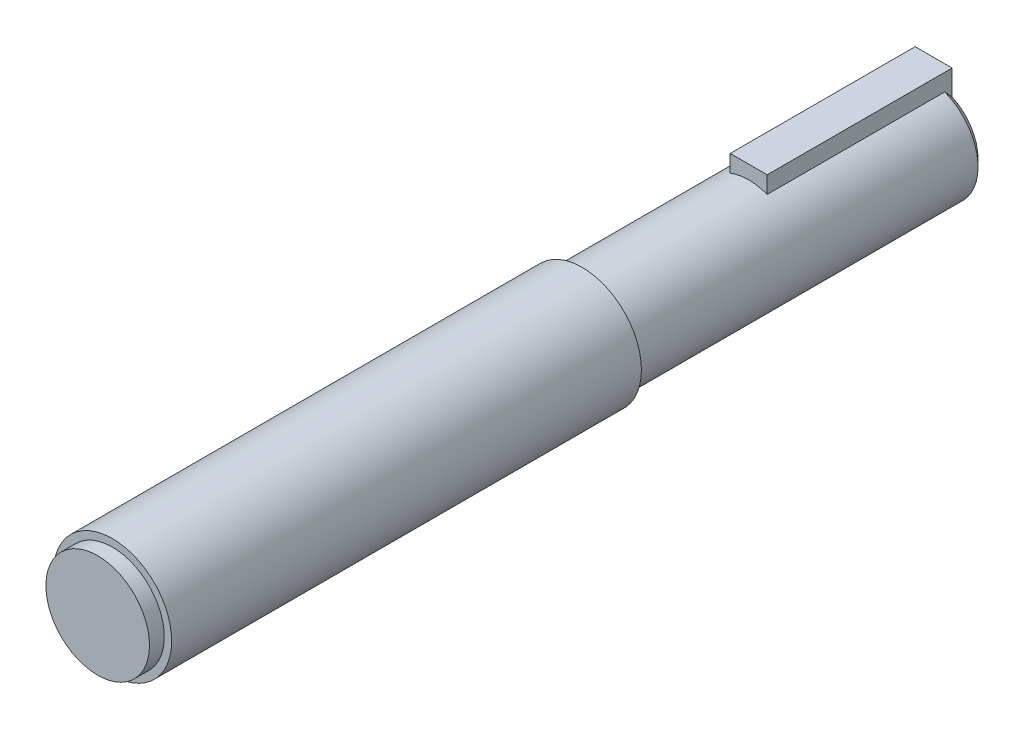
from build123d import *

# Parameters (mm, degrees)
SKETCH_1_R          = 7
EXTRUDE_1_DEPTH     = 47.5
SKETCH_2_R          = 8
EXTRUDE_2_DEPTH     = 63.5
CUT_EXTRUDE_1_DEPTH = 25
SKETCH_4_W          = 5
SKETCH_4_H          = 5
EXTRUDE_3_DEPTH     = 25
SKETCH_5_R          = 7
EXTRUDE_4_DEPTH     = 2
CHAMFER_1_SIZE      = 1


with BuildPart() as part:
    # Sketch 1 → Extrude 1 (new body)
    with BuildSketch(Plane.XY):
        Circle(SKETCH_1_R)
    extrude(amount=EXTRUDE_1_DEPTH)

    # Sketch 2 → Extrude 2 (add)
    with BuildSketch(Plane.XY.offset(47.5)):
        Circle(SKETCH_2_R)
    extrude(amount=EXTRUDE_2_DEPTH)

    # Sketch 3 → Cut-Extrude 1 (cut)
    with BuildSketch(Plane(origin=(0, 0, 0), x_dir=(-1, 0, 0), z_dir=(0, 0, -1))):
        with BuildLine():
            Line((-2.5, 6.538348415), (-2.5, 3.838348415))
            Line((-2.5, 3.838348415), (2.5, 3.838348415))
            Line((2.5, 3.838348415), (2.5, 6.538348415))
            ThreePointArc((2.5, 6.538348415), (0, 7), (-2.5, 6.538348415))
        make_face()
    extrude(amount=-CUT_EXTRUDE_1_DEPTH, mode=Mode.SUBTRACT)

    # Sketch 4 → Extrude 3 (add)
    with BuildSketch(Plane(origin=(0, 0, 0), x_dir=(-1, 0, 0), z_dir=(0, 0, -1))):
        with Locations((0, 6.338348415)):
            Rectangle(SKETCH_4_W, SKETCH_4_H)
    extrude(amount=-EXTRUDE_3_DEPTH)

    # Sketch 5 → Extrude 4 (add)
    with BuildSketch(Plane.XY.offset(111)):
        with Locations(Location((0, 0, 0), (0, 0, 110.924832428))):
            Circle(SKETCH_5_R)
    extrude(amount=EXTRUDE_4_DEPTH)

    # Chamfer 1
    chamfer_1_edges = [part.edges().sort_by_distance(p)[0] for p in [
        (-3.968626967, -5.766281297, 0),
    ]]
    chamfer(chamfer_1_edges, length=CHAMFER_1_SIZE)


solid = part.part
